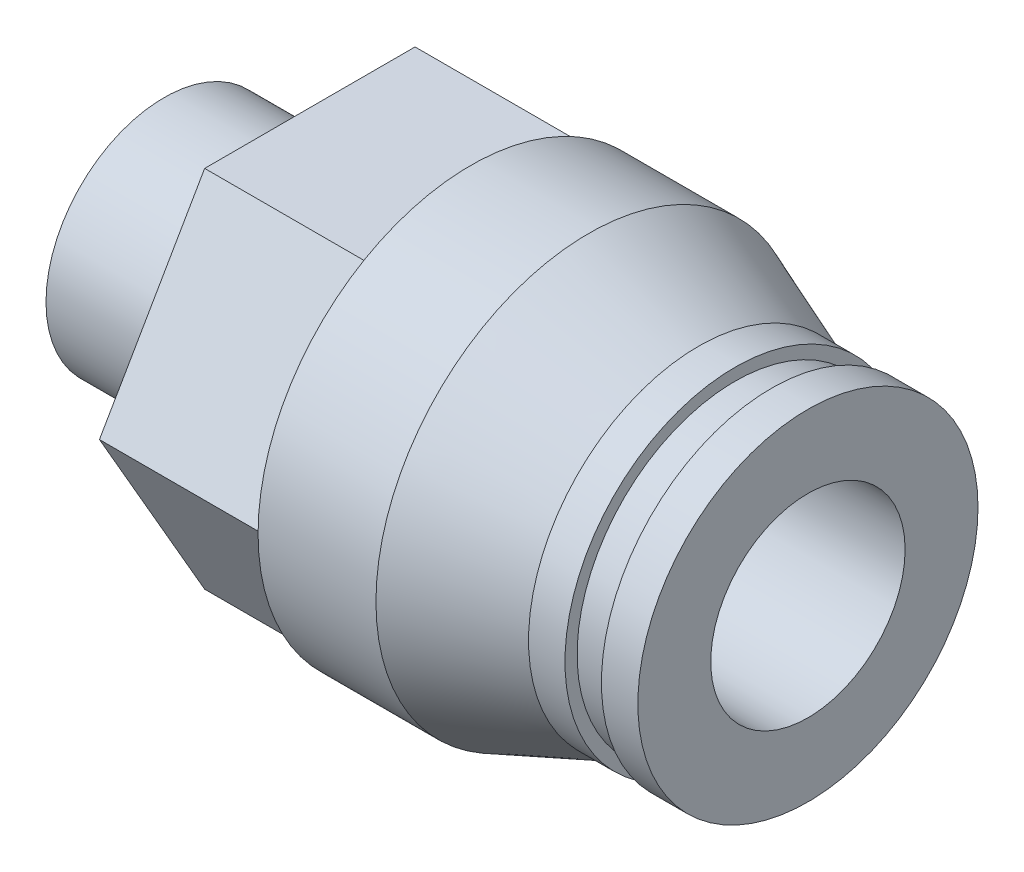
ISO-10303-21;
HEADER;
FILE_DESCRIPTION(('STEP AP214'),'2;1');
FILE_NAME('part.step','',(''),(''),'','','');
FILE_SCHEMA(('AUTOMOTIVE_DESIGN { 1 0 10303 214 1 1 1 1 }'));
ENDSEC;
DATA;
#1=APPLICATION_CONTEXT('core data for automotive mechanical design processes');
#2=APPLICATION_PROTOCOL_DEFINITION('international standard','automotive_design',2000,#1);
#3=PRODUCT_CONTEXT('',#1,'mechanical');
#4=PRODUCT('Part','Part','',(#3));
#5=PRODUCT_RELATED_PRODUCT_CATEGORY('part','',(#4));
#6=PRODUCT_DEFINITION_FORMATION('','',#4);
#7=PRODUCT_DEFINITION_CONTEXT('part definition',#1,'design');
#8=PRODUCT_DEFINITION('design','',#6,#7);
#9=PRODUCT_DEFINITION_SHAPE('','',#8);
#10=(LENGTH_UNIT() NAMED_UNIT(*) SI_UNIT(.MILLI.,.METRE.));
#11=(NAMED_UNIT(*) PLANE_ANGLE_UNIT() SI_UNIT($,.RADIAN.));
#12=(NAMED_UNIT(*) SI_UNIT($,.STERADIAN.) SOLID_ANGLE_UNIT());
#13=UNCERTAINTY_MEASURE_WITH_UNIT(LENGTH_MEASURE(1.E-05),#10,'distance_accuracy_value','');
#14=(GEOMETRIC_REPRESENTATION_CONTEXT(3) GLOBAL_UNCERTAINTY_ASSIGNED_CONTEXT((#13)) GLOBAL_UNIT_ASSIGNED_CONTEXT((#10,
#11,#12)) REPRESENTATION_CONTEXT('',''));
#15=CARTESIAN_POINT('',(0.,0.,0.));
#16=DIRECTION('',(0.,0.,1.));
#17=DIRECTION('',(1.,0.,0.));
#18=AXIS2_PLACEMENT_3D('',#15,#16,#17);
#19=CARTESIAN_POINT('',(6.,4.86,0.));
#20=DIRECTION('',(-1.,0.,0.));
#21=DIRECTION('',(0.,0.,1.));
#22=AXIS2_PLACEMENT_3D('',#19,#20,#21);
#23=PLANE('',#22);
#24=CARTESIAN_POINT('',(6.,0.,0.));
#25=DIRECTION('',(1.,0.,0.));
#26=DIRECTION('',(0.,0.,-1.));
#27=AXIS2_PLACEMENT_3D('',#24,#25,#26);
#28=CIRCLE('',#27,4.86);
#29=CARTESIAN_POINT('',(6.,0.,-4.86));
#30=VERTEX_POINT('',#29);
#31=EDGE_CURVE('E218',#30,#30,#28,.T.);
#32=ORIENTED_EDGE('',*,*,#31,.T.);
#33=EDGE_LOOP('',(#32));
#34=FACE_BOUND('',#33,.T.);
#35=DIRECTION('',(0.,-0.866025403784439,0.5));
#36=VECTOR('',#35,1.);
#37=CARTESIAN_POINT('',(6.,0.,-8.66025403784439));
#38=LINE('',#37,#36);
#39=CARTESIAN_POINT('',(6.,0.,-8.66025403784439));
#40=VERTEX_POINT('',#39);
#41=CARTESIAN_POINT('',(6.,-7.5,-4.33012701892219));
#42=VERTEX_POINT('',#41);
#43=EDGE_CURVE('E127',#40,#42,#38,.T.);
#44=ORIENTED_EDGE('',*,*,#43,.T.);
#45=DIRECTION('',(0.,0.,1.));
#46=VECTOR('',#45,1.);
#47=CARTESIAN_POINT('',(6.,-7.5,-4.33012701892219));
#48=LINE('',#47,#46);
#49=CARTESIAN_POINT('',(6.,-7.5,4.3301270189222));
#50=VERTEX_POINT('',#49);
#51=EDGE_CURVE('E110',#42,#50,#48,.T.);
#52=ORIENTED_EDGE('',*,*,#51,.T.);
#53=DIRECTION('',(0.,0.866025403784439,0.5));
#54=VECTOR('',#53,1.);
#55=CARTESIAN_POINT('',(6.,-7.5,4.3301270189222));
#56=LINE('',#55,#54);
#57=CARTESIAN_POINT('',(6.,0.,8.66025403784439));
#58=VERTEX_POINT('',#57);
#59=EDGE_CURVE('E121',#50,#58,#56,.T.);
#60=ORIENTED_EDGE('',*,*,#59,.T.);
#61=DIRECTION('',(0.,0.866025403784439,-0.5));
#62=VECTOR('',#61,1.);
#63=CARTESIAN_POINT('',(6.,0.,8.66025403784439));
#64=LINE('',#63,#62);
#65=CARTESIAN_POINT('',(6.,7.5,4.33012701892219));
#66=VERTEX_POINT('',#65);
#67=EDGE_CURVE('E30',#58,#66,#64,.T.);
#68=ORIENTED_EDGE('',*,*,#67,.T.);
#69=DIRECTION('',(0.,0.,-1.));
#70=VECTOR('',#69,1.);
#71=CARTESIAN_POINT('',(6.,7.5,4.33012701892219));
#72=LINE('',#71,#70);
#73=CARTESIAN_POINT('',(6.,7.5,-4.3301270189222));
#74=VERTEX_POINT('',#73);
#75=EDGE_CURVE('E131',#66,#74,#72,.T.);
#76=ORIENTED_EDGE('',*,*,#75,.T.);
#77=DIRECTION('',(0.,-0.866025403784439,-0.5));
#78=VECTOR('',#77,1.);
#79=CARTESIAN_POINT('',(6.,7.5,-4.3301270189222));
#80=LINE('',#79,#78);
#81=EDGE_CURVE('E134',#74,#40,#80,.T.);
#82=ORIENTED_EDGE('',*,*,#81,.T.);
#83=EDGE_LOOP('',(#44,#52,#60,#68,#76,#82));
#84=FACE_BOUND('',#83,.T.);
#85=ADVANCED_FACE('F15',(#34,#84),#23,.T.);
#86=CARTESIAN_POINT('',(0.,0.,0.));
#87=DIRECTION('',(-1.,0.,0.));
#88=DIRECTION('',(0.,0.,1.));
#89=AXIS2_PLACEMENT_3D('',#86,#87,#88);
#90=PLANE('',#89);
#91=CARTESIAN_POINT('',(0.,0.,0.));
#92=DIRECTION('',(1.,0.,0.));
#93=DIRECTION('',(0.,0.,-1.));
#94=AXIS2_PLACEMENT_3D('',#91,#92,#93);
#95=CIRCLE('',#94,4.86);
#96=CARTESIAN_POINT('',(0.,0.,-4.86));
#97=VERTEX_POINT('',#96);
#98=EDGE_CURVE('E221',#97,#97,#95,.T.);
#99=ORIENTED_EDGE('',*,*,#98,.F.);
#100=EDGE_LOOP('',(#99));
#101=FACE_BOUND('',#100,.T.);
#102=DIRECTION('',(0.,-0.866025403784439,-0.5));
#103=VECTOR('',#102,1.);
#104=CARTESIAN_POINT('',(0.,0.,2.88675134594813));
#105=LINE('',#104,#103);
#106=CARTESIAN_POINT('',(0.,0.,2.88675134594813));
#107=VERTEX_POINT('',#106);
#108=CARTESIAN_POINT('',(0.,-2.5,1.44337567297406));
#109=VERTEX_POINT('',#108);
#110=EDGE_CURVE('E176',#107,#109,#105,.T.);
#111=ORIENTED_EDGE('',*,*,#110,.T.);
#112=DIRECTION('',(0.,0.,-1.));
#113=VECTOR('',#112,1.);
#114=CARTESIAN_POINT('',(0.,-2.5,1.44337567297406));
#115=LINE('',#114,#113);
#116=CARTESIAN_POINT('',(0.,-2.5,-1.44337567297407));
#117=VERTEX_POINT('',#116);
#118=EDGE_CURVE('E38',#109,#117,#115,.T.);
#119=ORIENTED_EDGE('',*,*,#118,.T.);
#120=DIRECTION('',(0.,0.866025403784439,-0.5));
#121=VECTOR('',#120,1.);
#122=CARTESIAN_POINT('',(0.,-2.5,-1.44337567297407));
#123=LINE('',#122,#121);
#124=CARTESIAN_POINT('',(0.,0.,-2.88675134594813));
#125=VERTEX_POINT('',#124);
#126=EDGE_CURVE('E164',#117,#125,#123,.T.);
#127=ORIENTED_EDGE('',*,*,#126,.T.);
#128=DIRECTION('',(0.,0.866025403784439,0.5));
#129=VECTOR('',#128,1.);
#130=CARTESIAN_POINT('',(0.,0.,-2.88675134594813));
#131=LINE('',#130,#129);
#132=CARTESIAN_POINT('',(0.,2.5,-1.44337567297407));
#133=VERTEX_POINT('',#132);
#134=EDGE_CURVE('E167',#125,#133,#131,.T.);
#135=ORIENTED_EDGE('',*,*,#134,.T.);
#136=DIRECTION('',(0.,0.,1.));
#137=VECTOR('',#136,1.);
#138=CARTESIAN_POINT('',(0.,2.5,-1.44337567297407));
#139=LINE('',#138,#137);
#140=CARTESIAN_POINT('',(0.,2.5,1.44337567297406));
#141=VERTEX_POINT('',#140);
#142=EDGE_CURVE('E170',#133,#141,#139,.T.);
#143=ORIENTED_EDGE('',*,*,#142,.T.);
#144=DIRECTION('',(0.,-0.866025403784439,0.5));
#145=VECTOR('',#144,1.);
#146=CARTESIAN_POINT('',(0.,2.5,1.44337567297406));
#147=LINE('',#146,#145);
#148=EDGE_CURVE('E173',#141,#107,#147,.T.);
#149=ORIENTED_EDGE('',*,*,#148,.T.);
#150=EDGE_LOOP('',(#111,#119,#127,#135,#143,#149));
#151=FACE_BOUND('',#150,.T.);
#152=ADVANCED_FACE('F17',(#101,#151),#90,.T.);
#153=CARTESIAN_POINT('',(9.,4.,0.));
#154=DIRECTION('',(1.,0.,0.));
#155=DIRECTION('',(0.,0.,-1.));
#156=AXIS2_PLACEMENT_3D('',#153,#154,#155);
#157=PLANE('',#156);
#158=CARTESIAN_POINT('',(9.,0.,0.));
#159=DIRECTION('',(1.,0.,0.));
#160=DIRECTION('',(0.,0.,-1.));
#161=AXIS2_PLACEMENT_3D('',#158,#159,#160);
#162=CIRCLE('',#161,4.);
#163=CARTESIAN_POINT('',(9.,0.,-4.));
#164=VERTEX_POINT('',#163);
#165=EDGE_CURVE('E191',#164,#164,#162,.T.);
#166=ORIENTED_EDGE('',*,*,#165,.T.);
#167=EDGE_LOOP('',(#166));
#168=FACE_BOUND('',#167,.T.);
#169=DIRECTION('',(0.,-0.866025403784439,0.5));
#170=VECTOR('',#169,1.);
#171=CARTESIAN_POINT('',(9.,1.75,-3.89711431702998));
#172=LINE('',#171,#170);
#173=CARTESIAN_POINT('',(9.,0.,-2.88675134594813));
#174=VERTEX_POINT('',#173);
#175=CARTESIAN_POINT('',(9.,-2.5,-1.44337567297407));
#176=VERTEX_POINT('',#175);
#177=EDGE_CURVE('E23',#174,#176,#172,.T.);
#178=ORIENTED_EDGE('',*,*,#177,.T.);
#179=DIRECTION('',(0.,0.,1.));
#180=VECTOR('',#179,1.);
#181=CARTESIAN_POINT('',(9.,-2.5,0.));
#182=LINE('',#181,#180);
#183=CARTESIAN_POINT('',(9.,-2.5,1.44337567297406));
#184=VERTEX_POINT('',#183);
#185=EDGE_CURVE('E9',#176,#184,#182,.T.);
#186=ORIENTED_EDGE('',*,*,#185,.T.);
#187=DIRECTION('',(0.,0.866025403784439,0.5));
#188=VECTOR('',#187,1.);
#189=CARTESIAN_POINT('',(9.,1.75,3.89711431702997));
#190=LINE('',#189,#188);
#191=CARTESIAN_POINT('',(9.,0.,2.88675134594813));
#192=VERTEX_POINT('',#191);
#193=EDGE_CURVE('E224',#184,#192,#190,.T.);
#194=ORIENTED_EDGE('',*,*,#193,.T.);
#195=DIRECTION('',(0.,0.866025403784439,-0.5));
#196=VECTOR('',#195,1.);
#197=CARTESIAN_POINT('',(9.,4.25,0.433012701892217));
#198=LINE('',#197,#196);
#199=CARTESIAN_POINT('',(9.,2.5,1.44337567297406));
#200=VERTEX_POINT('',#199);
#201=EDGE_CURVE('E227',#192,#200,#198,.T.);
#202=ORIENTED_EDGE('',*,*,#201,.T.);
#203=DIRECTION('',(0.,0.,-1.));
#204=VECTOR('',#203,1.);
#205=CARTESIAN_POINT('',(9.,2.5,0.));
#206=LINE('',#205,#204);
#207=CARTESIAN_POINT('',(9.,2.5,-1.44337567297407));
#208=VERTEX_POINT('',#207);
#209=EDGE_CURVE('E230',#200,#208,#206,.T.);
#210=ORIENTED_EDGE('',*,*,#209,.T.);
#211=DIRECTION('',(0.,-0.866025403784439,-0.5));
#212=VECTOR('',#211,1.);
#213=CARTESIAN_POINT('',(9.,4.25,-0.433012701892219));
#214=LINE('',#213,#212);
#215=EDGE_CURVE('E233',#208,#174,#214,.T.);
#216=ORIENTED_EDGE('',*,*,#215,.T.);
#217=EDGE_LOOP('',(#178,#186,#194,#202,#210,#216));
#218=FACE_BOUND('',#217,.T.);
#219=ADVANCED_FACE('F237',(#168,#218),#157,.T.);
#220=CARTESIAN_POINT('',(0.,0.,0.));
#221=DIRECTION('',(1.,0.,0.));
#222=DIRECTION('',(0.,0.,-1.));
#223=AXIS2_PLACEMENT_3D('',#220,#221,#222);
#224=CYLINDRICAL_SURFACE('',#223,4.86);
#225=ORIENTED_EDGE('',*,*,#98,.T.);
#226=EDGE_LOOP('',(#225));
#227=FACE_BOUND('',#226,.T.);
#228=ORIENTED_EDGE('',*,*,#31,.F.);
#229=EDGE_LOOP('',(#228));
#230=FACE_BOUND('',#229,.T.);
#231=ADVANCED_FACE('F278',(#227,#230),#224,.T.);
#232=CARTESIAN_POINT('',(0.,0.,0.));
#233=DIRECTION('',(1.,0.,0.));
#234=DIRECTION('',(0.,0.,-1.));
#235=AXIS2_PLACEMENT_3D('',#232,#233,#234);
#236=CYLINDRICAL_SURFACE('',#235,8.75688111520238);
#237=CARTESIAN_POINT('',(12.625,0.,0.));
#238=DIRECTION('',(-1.,0.,0.));
#239=DIRECTION('',(0.,0.,1.));
#240=AXIS2_PLACEMENT_3D('',#237,#238,#239);
#241=CIRCLE('',#240,8.75688111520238);
#242=CARTESIAN_POINT('',(12.625,0.,8.75688111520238));
#243=VERTEX_POINT('',#242);
#244=EDGE_CURVE('E153',#243,#243,#241,.F.);
#245=ORIENTED_EDGE('',*,*,#244,.T.);
#246=EDGE_LOOP('',(#245));
#247=FACE_BOUND('',#246,.T.);
#248=CARTESIAN_POINT('',(17.4771203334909,0.,0.));
#249=DIRECTION('',(1.,0.,0.));
#250=DIRECTION('',(0.,0.,-1.));
#251=AXIS2_PLACEMENT_3D('',#248,#249,#250);
#252=CIRCLE('',#251,8.75688111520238);
#253=CARTESIAN_POINT('',(17.4771203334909,0.,-8.75688111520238));
#254=VERTEX_POINT('',#253);
#255=EDGE_CURVE('E215',#254,#254,#252,.T.);
#256=ORIENTED_EDGE('',*,*,#255,.F.);
#257=EDGE_LOOP('',(#256));
#258=FACE_BOUND('',#257,.T.);
#259=ADVANCED_FACE('F276',(#247,#258),#236,.T.);
#260=CARTESIAN_POINT('',(22.,0.,0.));
#261=DIRECTION('',(-1.,0.,0.));
#262=DIRECTION('',(0.,0.,1.));
#263=AXIS2_PLACEMENT_3D('',#260,#261,#262);
#264=CONICAL_SURFACE('',#263,7.,0.370503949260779);
#265=ORIENTED_EDGE('',*,*,#255,.T.);
#266=EDGE_LOOP('',(#265));
#267=FACE_BOUND('',#266,.T.);
#268=CARTESIAN_POINT('',(22.,0.,0.));
#269=DIRECTION('',(1.,0.,0.));
#270=DIRECTION('',(0.,0.,-1.));
#271=AXIS2_PLACEMENT_3D('',#268,#269,#270);
#272=CIRCLE('',#271,7.);
#273=CARTESIAN_POINT('',(22.,0.,-7.));
#274=VERTEX_POINT('',#273);
#275=EDGE_CURVE('E212',#274,#274,#272,.T.);
#276=ORIENTED_EDGE('',*,*,#275,.F.);
#277=EDGE_LOOP('',(#276));
#278=FACE_BOUND('',#277,.T.);
#279=ADVANCED_FACE('F285',(#267,#278),#264,.T.);
#280=CARTESIAN_POINT('',(0.,0.,0.));
#281=DIRECTION('',(1.,0.,0.));
#282=DIRECTION('',(0.,0.,-1.));
#283=AXIS2_PLACEMENT_3D('',#280,#281,#282);
#284=CYLINDRICAL_SURFACE('',#283,7.);
#285=ORIENTED_EDGE('',*,*,#275,.T.);
#286=EDGE_LOOP('',(#285));
#287=FACE_BOUND('',#286,.T.);
#288=CARTESIAN_POINT('',(23.5,0.,0.));
#289=DIRECTION('',(1.,0.,0.));
#290=DIRECTION('',(0.,0.,-1.));
#291=AXIS2_PLACEMENT_3D('',#288,#289,#290);
#292=CIRCLE('',#291,7.);
#293=CARTESIAN_POINT('',(23.5,0.,-7.));
#294=VERTEX_POINT('',#293);
#295=EDGE_CURVE('E209',#294,#294,#292,.T.);
#296=ORIENTED_EDGE('',*,*,#295,.F.);
#297=EDGE_LOOP('',(#296));
#298=FACE_BOUND('',#297,.T.);
#299=ADVANCED_FACE('F312',(#287,#298),#284,.T.);
#300=CARTESIAN_POINT('',(23.5,7.,0.));
#301=DIRECTION('',(1.,0.,0.));
#302=DIRECTION('',(0.,0.,-1.));
#303=AXIS2_PLACEMENT_3D('',#300,#301,#302);
#304=PLANE('',#303);
#305=ORIENTED_EDGE('',*,*,#295,.T.);
#306=EDGE_LOOP('',(#305));
#307=FACE_BOUND('',#306,.T.);
#308=CARTESIAN_POINT('',(23.5,0.,0.));
#309=DIRECTION('',(1.,0.,0.));
#310=DIRECTION('',(0.,0.,-1.));
#311=AXIS2_PLACEMENT_3D('',#308,#309,#310);
#312=CIRCLE('',#311,6.5);
#313=CARTESIAN_POINT('',(23.5,0.,-6.5));
#314=VERTEX_POINT('',#313);
#315=EDGE_CURVE('E206',#314,#314,#312,.T.);
#316=ORIENTED_EDGE('',*,*,#315,.F.);
#317=EDGE_LOOP('',(#316));
#318=FACE_BOUND('',#317,.T.);
#319=ADVANCED_FACE('F308',(#307,#318),#304,.T.);
#320=CARTESIAN_POINT('',(0.,0.,0.));
#321=DIRECTION('',(1.,0.,0.));
#322=DIRECTION('',(0.,0.,-1.));
#323=AXIS2_PLACEMENT_3D('',#320,#321,#322);
#324=CYLINDRICAL_SURFACE('',#323,6.5);
#325=ORIENTED_EDGE('',*,*,#315,.T.);
#326=EDGE_LOOP('',(#325));
#327=FACE_BOUND('',#326,.T.);
#328=CARTESIAN_POINT('',(25.,0.,0.));
#329=DIRECTION('',(1.,0.,0.));
#330=DIRECTION('',(0.,0.,-1.));
#331=AXIS2_PLACEMENT_3D('',#328,#329,#330);
#332=CIRCLE('',#331,6.5);
#333=CARTESIAN_POINT('',(25.,0.,-6.5));
#334=VERTEX_POINT('',#333);
#335=EDGE_CURVE('E203',#334,#334,#332,.T.);
#336=ORIENTED_EDGE('',*,*,#335,.F.);
#337=EDGE_LOOP('',(#336));
#338=FACE_BOUND('',#337,.T.);
#339=ADVANCED_FACE('F304',(#327,#338),#324,.T.);
#340=CARTESIAN_POINT('',(25.,6.5,0.));
#341=DIRECTION('',(-1.,0.,0.));
#342=DIRECTION('',(0.,0.,1.));
#343=AXIS2_PLACEMENT_3D('',#340,#341,#342);
#344=PLANE('',#343);
#345=ORIENTED_EDGE('',*,*,#335,.T.);
#346=EDGE_LOOP('',(#345));
#347=FACE_BOUND('',#346,.T.);
#348=CARTESIAN_POINT('',(25.,0.,0.));
#349=DIRECTION('',(1.,0.,0.));
#350=DIRECTION('',(0.,0.,-1.));
#351=AXIS2_PLACEMENT_3D('',#348,#349,#350);
#352=CIRCLE('',#351,7.);
#353=CARTESIAN_POINT('',(25.,0.,-7.));
#354=VERTEX_POINT('',#353);
#355=EDGE_CURVE('E200',#354,#354,#352,.T.);
#356=ORIENTED_EDGE('',*,*,#355,.F.);
#357=EDGE_LOOP('',(#356));
#358=FACE_BOUND('',#357,.T.);
#359=ADVANCED_FACE('F300',(#347,#358),#344,.T.);
#360=CARTESIAN_POINT('',(0.,0.,0.));
#361=DIRECTION('',(1.,0.,0.));
#362=DIRECTION('',(0.,0.,-1.));
#363=AXIS2_PLACEMENT_3D('',#360,#361,#362);
#364=CYLINDRICAL_SURFACE('',#363,7.);
#365=ORIENTED_EDGE('',*,*,#355,.T.);
#366=EDGE_LOOP('',(#365));
#367=FACE_BOUND('',#366,.T.);
#368=CARTESIAN_POINT('',(26.5,0.,0.));
#369=DIRECTION('',(1.,0.,0.));
#370=DIRECTION('',(0.,0.,-1.));
#371=AXIS2_PLACEMENT_3D('',#368,#369,#370);
#372=CIRCLE('',#371,7.);
#373=CARTESIAN_POINT('',(26.5,0.,-7.));
#374=VERTEX_POINT('',#373);
#375=EDGE_CURVE('E197',#374,#374,#372,.T.);
#376=ORIENTED_EDGE('',*,*,#375,.F.);
#377=EDGE_LOOP('',(#376));
#378=FACE_BOUND('',#377,.T.);
#379=ADVANCED_FACE('F296',(#367,#378),#364,.T.);
#380=CARTESIAN_POINT('',(26.5,7.,0.));
#381=DIRECTION('',(1.,0.,0.));
#382=DIRECTION('',(0.,0.,-1.));
#383=AXIS2_PLACEMENT_3D('',#380,#381,#382);
#384=PLANE('',#383);
#385=ORIENTED_EDGE('',*,*,#375,.T.);
#386=EDGE_LOOP('',(#385));
#387=FACE_BOUND('',#386,.T.);
#388=CARTESIAN_POINT('',(26.5,0.,0.));
#389=DIRECTION('',(1.,0.,0.));
#390=DIRECTION('',(0.,0.,-1.));
#391=AXIS2_PLACEMENT_3D('',#388,#389,#390);
#392=CIRCLE('',#391,4.);
#393=CARTESIAN_POINT('',(26.5,0.,-4.));
#394=VERTEX_POINT('',#393);
#395=EDGE_CURVE('E194',#394,#394,#392,.T.);
#396=ORIENTED_EDGE('',*,*,#395,.F.);
#397=EDGE_LOOP('',(#396));
#398=FACE_BOUND('',#397,.T.);
#399=ADVANCED_FACE('F264',(#387,#398),#384,.T.);
#400=CARTESIAN_POINT('',(0.,0.,0.));
#401=DIRECTION('',(1.,0.,0.));
#402=DIRECTION('',(0.,0.,-1.));
#403=AXIS2_PLACEMENT_3D('',#400,#401,#402);
#404=CYLINDRICAL_SURFACE('',#403,4.);
#405=ORIENTED_EDGE('',*,*,#395,.T.);
#406=EDGE_LOOP('',(#405));
#407=FACE_BOUND('',#406,.T.);
#408=ORIENTED_EDGE('',*,*,#165,.F.);
#409=EDGE_LOOP('',(#408));
#410=FACE_BOUND('',#409,.T.);
#411=ADVANCED_FACE('F256',(#407,#410),#404,.F.);
#412=CARTESIAN_POINT('',(26.5,-2.5,1.44337567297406));
#413=DIRECTION('',(0.,1.,0.));
#414=DIRECTION('',(0.,0.,1.));
#415=AXIS2_PLACEMENT_3D('',#412,#413,#414);
#416=PLANE('',#415);
#417=DIRECTION('',(-1.,0.,0.));
#418=VECTOR('',#417,1.);
#419=CARTESIAN_POINT('',(26.5,-2.5,-1.44337567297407));
#420=LINE('',#419,#418);
#421=EDGE_CURVE('E189',#176,#117,#420,.T.);
#422=ORIENTED_EDGE('',*,*,#421,.T.);
#423=ORIENTED_EDGE('',*,*,#118,.F.);
#424=DIRECTION('',(-1.,0.,0.));
#425=VECTOR('',#424,1.);
#426=CARTESIAN_POINT('',(26.5,-2.5,1.44337567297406));
#427=LINE('',#426,#425);
#428=EDGE_CURVE('E179',#184,#109,#427,.T.);
#429=ORIENTED_EDGE('',*,*,#428,.F.);
#430=ORIENTED_EDGE('',*,*,#185,.F.);
#431=EDGE_LOOP('',(#422,#423,#429,#430));
#432=FACE_BOUND('',#431,.T.);
#433=ADVANCED_FACE('F254',(#432),#416,.T.);
#434=CARTESIAN_POINT('',(26.5,-2.5,-1.44337567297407));
#435=DIRECTION('',(0.,0.5,0.866025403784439));
#436=DIRECTION('',(0.,-0.866025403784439,0.5));
#437=AXIS2_PLACEMENT_3D('',#434,#435,#436);
#438=PLANE('',#437);
#439=DIRECTION('',(-1.,0.,0.));
#440=VECTOR('',#439,1.);
#441=CARTESIAN_POINT('',(26.5,0.,-2.88675134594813));
#442=LINE('',#441,#440);
#443=EDGE_CURVE('E187',#174,#125,#442,.T.);
#444=ORIENTED_EDGE('',*,*,#443,.T.);
#445=ORIENTED_EDGE('',*,*,#126,.F.);
#446=ORIENTED_EDGE('',*,*,#421,.F.);
#447=ORIENTED_EDGE('',*,*,#177,.F.);
#448=EDGE_LOOP('',(#444,#445,#446,#447));
#449=FACE_BOUND('',#448,.T.);
#450=ADVANCED_FACE('F241',(#449),#438,.T.);
#451=CARTESIAN_POINT('',(26.5,0.,-2.88675134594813));
#452=DIRECTION('',(0.,-0.5,0.866025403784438));
#453=DIRECTION('',(0.,-0.866025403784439,-0.5));
#454=AXIS2_PLACEMENT_3D('',#451,#452,#453);
#455=PLANE('',#454);
#456=DIRECTION('',(-1.,0.,0.));
#457=VECTOR('',#456,1.);
#458=CARTESIAN_POINT('',(26.5,2.5,-1.44337567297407));
#459=LINE('',#458,#457);
#460=EDGE_CURVE('E185',#208,#133,#459,.T.);
#461=ORIENTED_EDGE('',*,*,#460,.T.);
#462=ORIENTED_EDGE('',*,*,#134,.F.);
#463=ORIENTED_EDGE('',*,*,#443,.F.);
#464=ORIENTED_EDGE('',*,*,#215,.F.);
#465=EDGE_LOOP('',(#461,#462,#463,#464));
#466=FACE_BOUND('',#465,.T.);
#467=ADVANCED_FACE('F245',(#466),#455,.T.);
#468=CARTESIAN_POINT('',(26.5,2.5,-1.44337567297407));
#469=DIRECTION('',(0.,-1.,0.));
#470=DIRECTION('',(0.,0.,-1.));
#471=AXIS2_PLACEMENT_3D('',#468,#469,#470);
#472=PLANE('',#471);
#473=DIRECTION('',(-1.,0.,0.));
#474=VECTOR('',#473,1.);
#475=CARTESIAN_POINT('',(26.5,2.5,1.44337567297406));
#476=LINE('',#475,#474);
#477=EDGE_CURVE('E183',#200,#141,#476,.T.);
#478=ORIENTED_EDGE('',*,*,#477,.T.);
#479=ORIENTED_EDGE('',*,*,#142,.F.);
#480=ORIENTED_EDGE('',*,*,#460,.F.);
#481=ORIENTED_EDGE('',*,*,#209,.F.);
#482=EDGE_LOOP('',(#478,#479,#480,#481));
#483=FACE_BOUND('',#482,.T.);
#484=ADVANCED_FACE('F405',(#483),#472,.T.);
#485=CARTESIAN_POINT('',(26.5,2.5,1.44337567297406));
#486=DIRECTION('',(0.,-0.5,-0.866025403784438));
#487=DIRECTION('',(0.,0.866025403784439,-0.5));
#488=AXIS2_PLACEMENT_3D('',#485,#486,#487);
#489=PLANE('',#488);
#490=DIRECTION('',(-1.,0.,0.));
#491=VECTOR('',#490,1.);
#492=CARTESIAN_POINT('',(26.5,0.,2.88675134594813));
#493=LINE('',#492,#491);
#494=EDGE_CURVE('E181',#192,#107,#493,.T.);
#495=ORIENTED_EDGE('',*,*,#494,.T.);
#496=ORIENTED_EDGE('',*,*,#148,.F.);
#497=ORIENTED_EDGE('',*,*,#477,.F.);
#498=ORIENTED_EDGE('',*,*,#201,.F.);
#499=EDGE_LOOP('',(#495,#496,#497,#498));
#500=FACE_BOUND('',#499,.T.);
#501=ADVANCED_FACE('F414',(#500),#489,.T.);
#502=CARTESIAN_POINT('',(26.5,0.,2.88675134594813));
#503=DIRECTION('',(0.,0.5,-0.866025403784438));
#504=DIRECTION('',(0.,0.866025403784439,0.5));
#505=AXIS2_PLACEMENT_3D('',#502,#503,#504);
#506=PLANE('',#505);
#507=ORIENTED_EDGE('',*,*,#428,.T.);
#508=ORIENTED_EDGE('',*,*,#110,.F.);
#509=ORIENTED_EDGE('',*,*,#494,.F.);
#510=ORIENTED_EDGE('',*,*,#193,.F.);
#511=EDGE_LOOP('',(#507,#508,#509,#510));
#512=FACE_BOUND('',#511,.T.);
#513=ADVANCED_FACE('F252',(#512),#506,.T.);
#514=CARTESIAN_POINT('',(12.625,0.,0.));
#515=DIRECTION('',(-1.,0.,0.));
#516=DIRECTION('',(0.,0.,1.));
#517=AXIS2_PLACEMENT_3D('',#514,#515,#516);
#518=PLANE('',#517);
#519=ORIENTED_EDGE('',*,*,#244,.F.);
#520=EDGE_LOOP('',(#519));
#521=FACE_BOUND('',#520,.T.);
#522=DIRECTION('',(0.,-0.866025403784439,0.5));
#523=VECTOR('',#522,1.);
#524=CARTESIAN_POINT('',(12.625,0.,-8.66025403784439));
#525=LINE('',#524,#523);
#526=CARTESIAN_POINT('',(12.625,0.,-8.66025403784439));
#527=VERTEX_POINT('',#526);
#528=CARTESIAN_POINT('',(12.625,-7.5,-4.33012701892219));
#529=VERTEX_POINT('',#528);
#530=EDGE_CURVE('E118',#527,#529,#525,.T.);
#531=ORIENTED_EDGE('',*,*,#530,.F.);
#532=DIRECTION('',(0.,-0.866025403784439,-0.5));
#533=VECTOR('',#532,1.);
#534=CARTESIAN_POINT('',(12.625,7.5,-4.3301270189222));
#535=LINE('',#534,#533);
#536=CARTESIAN_POINT('',(12.625,7.5,-4.3301270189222));
#537=VERTEX_POINT('',#536);
#538=EDGE_CURVE('E146',#537,#527,#535,.T.);
#539=ORIENTED_EDGE('',*,*,#538,.F.);
#540=DIRECTION('',(0.,0.,-1.));
#541=VECTOR('',#540,1.);
#542=CARTESIAN_POINT('',(12.625,7.5,4.33012701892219));
#543=LINE('',#542,#541);
#544=CARTESIAN_POINT('',(12.625,7.5,4.33012701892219));
#545=VERTEX_POINT('',#544);
#546=EDGE_CURVE('E143',#545,#537,#543,.T.);
#547=ORIENTED_EDGE('',*,*,#546,.F.);
#548=DIRECTION('',(0.,0.866025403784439,-0.5));
#549=VECTOR('',#548,1.);
#550=CARTESIAN_POINT('',(12.625,0.,8.66025403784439));
#551=LINE('',#550,#549);
#552=CARTESIAN_POINT('',(12.625,0.,8.66025403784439));
#553=VERTEX_POINT('',#552);
#554=EDGE_CURVE('E140',#553,#545,#551,.T.);
#555=ORIENTED_EDGE('',*,*,#554,.F.);
#556=DIRECTION('',(0.,0.866025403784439,0.5));
#557=VECTOR('',#556,1.);
#558=CARTESIAN_POINT('',(12.625,-7.5,4.3301270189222));
#559=LINE('',#558,#557);
#560=CARTESIAN_POINT('',(12.625,-7.5,4.3301270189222));
#561=VERTEX_POINT('',#560);
#562=EDGE_CURVE('E138',#561,#553,#559,.T.);
#563=ORIENTED_EDGE('',*,*,#562,.F.);
#564=DIRECTION('',(0.,0.,1.));
#565=VECTOR('',#564,1.);
#566=CARTESIAN_POINT('',(12.625,-7.5,-4.33012701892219));
#567=LINE('',#566,#565);
#568=EDGE_CURVE('E113',#529,#561,#567,.T.);
#569=ORIENTED_EDGE('',*,*,#568,.F.);
#570=EDGE_LOOP('',(#531,#539,#547,#555,#563,#569));
#571=FACE_BOUND('',#570,.T.);
#572=ADVANCED_FACE('F433',(#521,#571),#518,.T.);
#573=CARTESIAN_POINT('',(12.625,-7.5,-4.33012701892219));
#574=DIRECTION('',(0.,-1.,0.));
#575=DIRECTION('',(0.,0.,-1.));
#576=AXIS2_PLACEMENT_3D('',#573,#574,#575);
#577=PLANE('',#576);
#578=DIRECTION('',(-1.,0.,0.));
#579=VECTOR('',#578,1.);
#580=CARTESIAN_POINT('',(12.625,-7.5,-4.33012701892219));
#581=LINE('',#580,#579);
#582=EDGE_CURVE('E151',#529,#42,#581,.T.);
#583=ORIENTED_EDGE('',*,*,#582,.F.);
#584=ORIENTED_EDGE('',*,*,#568,.T.);
#585=DIRECTION('',(-1.,0.,0.));
#586=VECTOR('',#585,1.);
#587=CARTESIAN_POINT('',(12.625,-7.5,4.3301270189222));
#588=LINE('',#587,#586);
#589=EDGE_CURVE('E106',#561,#50,#588,.T.);
#590=ORIENTED_EDGE('',*,*,#589,.T.);
#591=ORIENTED_EDGE('',*,*,#51,.F.);
#592=EDGE_LOOP('',(#583,#584,#590,#591));
#593=FACE_BOUND('',#592,.T.);
#594=ADVANCED_FACE('F108',(#593),#577,.T.);
#595=CARTESIAN_POINT('',(12.625,0.,-8.66025403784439));
#596=DIRECTION('',(0.,-0.5,-0.866025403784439));
#597=DIRECTION('',(0.,0.866025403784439,-0.5));
#598=AXIS2_PLACEMENT_3D('',#595,#596,#597);
#599=PLANE('',#598);
#600=DIRECTION('',(-1.,0.,0.));
#601=VECTOR('',#600,1.);
#602=CARTESIAN_POINT('',(12.625,0.,-8.66025403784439));
#603=LINE('',#602,#601);
#604=EDGE_CURVE('E154',#527,#40,#603,.T.);
#605=ORIENTED_EDGE('',*,*,#604,.F.);
#606=ORIENTED_EDGE('',*,*,#530,.T.);
#607=ORIENTED_EDGE('',*,*,#582,.T.);
#608=ORIENTED_EDGE('',*,*,#43,.F.);
#609=EDGE_LOOP('',(#605,#606,#607,#608));
#610=FACE_BOUND('',#609,.T.);
#611=ADVANCED_FACE('F451',(#610),#599,.T.);
#612=CARTESIAN_POINT('',(12.625,7.5,-4.3301270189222));
#613=DIRECTION('',(0.,0.5,-0.866025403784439));
#614=DIRECTION('',(0.,0.866025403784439,0.5));
#615=AXIS2_PLACEMENT_3D('',#612,#613,#614);
#616=PLANE('',#615);
#617=DIRECTION('',(-1.,0.,0.));
#618=VECTOR('',#617,1.);
#619=CARTESIAN_POINT('',(12.625,7.5,-4.3301270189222));
#620=LINE('',#619,#618);
#621=EDGE_CURVE('E156',#537,#74,#620,.T.);
#622=ORIENTED_EDGE('',*,*,#621,.F.);
#623=ORIENTED_EDGE('',*,*,#538,.T.);
#624=ORIENTED_EDGE('',*,*,#604,.T.);
#625=ORIENTED_EDGE('',*,*,#81,.F.);
#626=EDGE_LOOP('',(#622,#623,#624,#625));
#627=FACE_BOUND('',#626,.T.);
#628=ADVANCED_FACE('F460',(#627),#616,.T.);
#629=CARTESIAN_POINT('',(12.625,7.5,4.33012701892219));
#630=DIRECTION('',(0.,1.,0.));
#631=DIRECTION('',(0.,0.,1.));
#632=AXIS2_PLACEMENT_3D('',#629,#630,#631);
#633=PLANE('',#632);
#634=DIRECTION('',(-1.,0.,0.));
#635=VECTOR('',#634,1.);
#636=CARTESIAN_POINT('',(12.625,7.5,4.33012701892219));
#637=LINE('',#636,#635);
#638=EDGE_CURVE('E158',#545,#66,#637,.T.);
#639=ORIENTED_EDGE('',*,*,#638,.F.);
#640=ORIENTED_EDGE('',*,*,#546,.T.);
#641=ORIENTED_EDGE('',*,*,#621,.T.);
#642=ORIENTED_EDGE('',*,*,#75,.F.);
#643=EDGE_LOOP('',(#639,#640,#641,#642));
#644=FACE_BOUND('',#643,.T.);
#645=ADVANCED_FACE('F470',(#644),#633,.T.);
#646=CARTESIAN_POINT('',(12.625,0.,8.66025403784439));
#647=DIRECTION('',(0.,0.5,0.866025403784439));
#648=DIRECTION('',(0.,-0.866025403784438,0.5));
#649=AXIS2_PLACEMENT_3D('',#646,#647,#648);
#650=PLANE('',#649);
#651=DIRECTION('',(-1.,0.,0.));
#652=VECTOR('',#651,1.);
#653=CARTESIAN_POINT('',(12.625,0.,8.66025403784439));
#654=LINE('',#653,#652);
#655=EDGE_CURVE('E117',#553,#58,#654,.T.);
#656=ORIENTED_EDGE('',*,*,#655,.F.);
#657=ORIENTED_EDGE('',*,*,#554,.T.);
#658=ORIENTED_EDGE('',*,*,#638,.T.);
#659=ORIENTED_EDGE('',*,*,#67,.F.);
#660=EDGE_LOOP('',(#656,#657,#658,#659));
#661=FACE_BOUND('',#660,.T.);
#662=ADVANCED_FACE('F480',(#661),#650,.T.);
#663=CARTESIAN_POINT('',(12.625,-7.5,4.3301270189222));
#664=DIRECTION('',(0.,-0.5,0.866025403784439));
#665=DIRECTION('',(0.,-0.866025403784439,-0.5));
#666=AXIS2_PLACEMENT_3D('',#663,#664,#665);
#667=PLANE('',#666);
#668=ORIENTED_EDGE('',*,*,#589,.F.);
#669=ORIENTED_EDGE('',*,*,#562,.T.);
#670=ORIENTED_EDGE('',*,*,#655,.T.);
#671=ORIENTED_EDGE('',*,*,#59,.F.);
#672=EDGE_LOOP('',(#668,#669,#670,#671));
#673=FACE_BOUND('',#672,.T.);
#674=ADVANCED_FACE('F122',(#673),#667,.T.);
#675=CLOSED_SHELL('',(#85,#152,#219,#231,#259,#279,#299,#319,#339,#359,#379,#399,#411,#433,#450,
#467,#484,#501,#513,#572,#594,#611,#628,#645,#662,#674));
#676=MANIFOLD_SOLID_BREP('B1',#675);
#677=ADVANCED_BREP_SHAPE_REPRESENTATION('',(#18,#676),#14);
#678=SHAPE_DEFINITION_REPRESENTATION(#9,#677);
ENDSEC;
END-ISO-10303-21;
